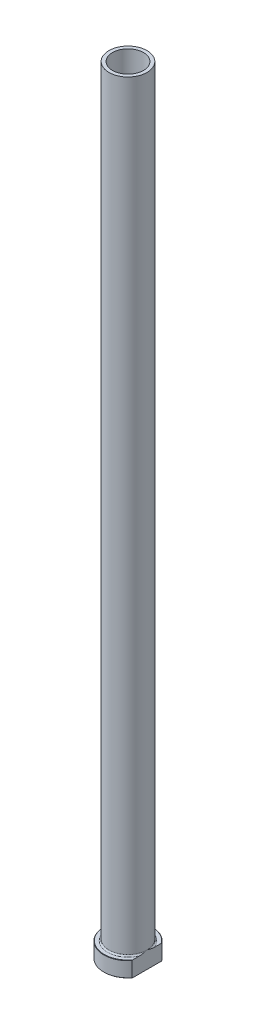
from build123d import *

# Parameters (mm, degrees)
FILLET1_R          = 0.8
CHAMFER1_SIZE      = 0.2
CUT_EXTRUDE1_DEPTH = 451.435344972
CHAMFER2_SIZE      = 0.5


with BuildPart() as part:
    # Sketch1 → Revolve1 (revolve)
    with BuildSketch(Plane.XY, mode=Mode.PRIVATE) as revolve1_sk:
        Polygon((-9, 450), (-11, 450), (-11, 9), (-14, 9), (-14, 0), (-9.25, 0), (-9.25, 383), (-9, 395), align=None)
    revolve(revolve1_sk.sketch.rotate(Axis((0, 92.187680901, 0), (0, -1, 0)), 270), axis=Axis((0, 92.187680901, 0), (0, -1, 0)))

    # Fillet1
    fillet1_edges = [part.edges().sort_by_distance(p)[0] for p in [
        (0, 9, -11),
    ]]
    fillet(fillet1_edges, radius=FILLET1_R)

    # Chamfer1
    chamfer1_edges = [part.edges().sort_by_distance(p)[0] for p in [
        (0, 0, -14),
        (0, 9, -14),
    ]]
    chamfer(chamfer1_edges, length=CHAMFER1_SIZE)

    # Sketch2 → Cut-Extrude1 (cut, through all)
    with BuildSketch(Plane.XZ):
        with BuildLine():
            Line((11, 8.660254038), (11, -8.660254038))
            ThreePointArc((11, -8.660254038), (14, 0), (11, 8.660254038))
        make_face()
    extrude(amount=-CUT_EXTRUDE1_DEPTH, mode=Mode.SUBTRACT)

    # Chamfer2
    chamfer2_edges = [part.edges().sort_by_distance(p)[0] for p in [
        (0, 0, -9.25),
    ]]
    chamfer(chamfer2_edges, length=CHAMFER2_SIZE)


solid = part.part
